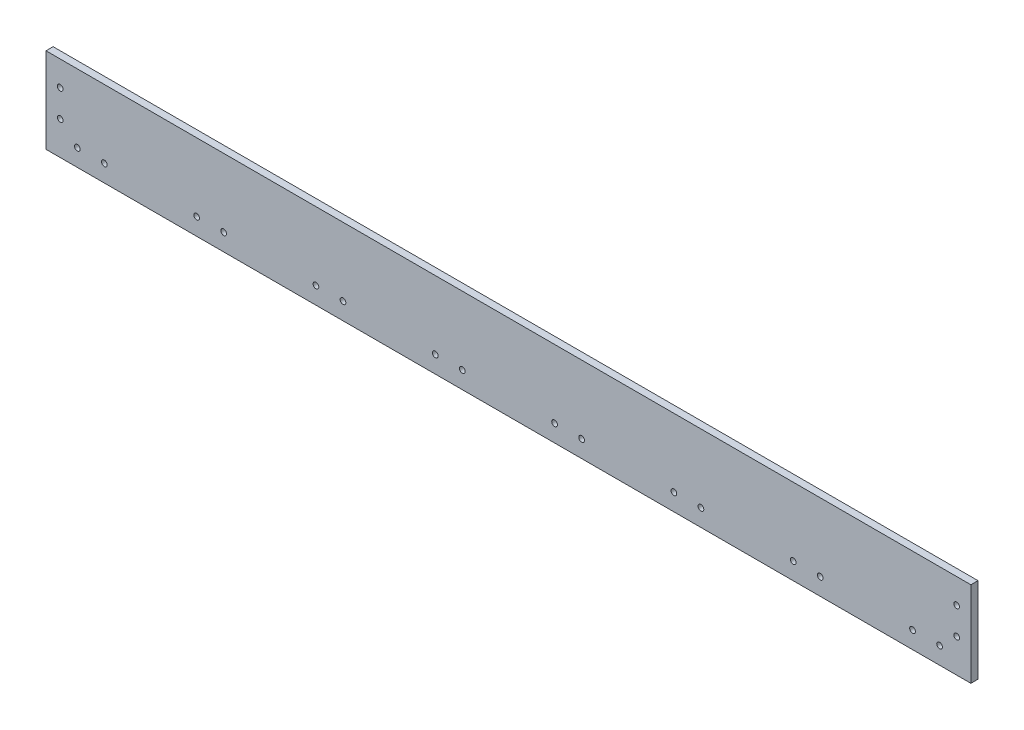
from build123d import *

# Parameters (mm, degrees)
SKETCH1_W           = 825.5
SKETCH1_H           = 76.2
BOSS_EXTRUDE1_DEPTH = 6.35
SKETCH2_R           = 2.54
CUT_EXTRUDE1_DEPTH  = 6.35
SKETCH3_R           = 2.54
CUT_EXTRUDE2_DEPTH  = 6.35
LPATTERN2_COUNT     = 8
LPATTERN2_PITCH     = 106.498571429


with BuildPart() as part:
    # Sketch1 → Boss-Extrude1 (new body)
    with BuildSketch(Plane.XY):
        with Locations((412.75, 38.1)):
            Rectangle(SKETCH1_W, SKETCH1_H)
    extrude(amount=BOSS_EXTRUDE1_DEPTH)

    # Sketch2 → Cut-Extrude1 (cut)
    with BuildSketch(Plane.XY.offset(6.35)):
        with Locations((27.94, 15.24)):
            Circle(SKETCH2_R)
        with Locations((52.07, 15.24)):
            Circle(SKETCH2_R)
    cut_extrude1 = extrude(amount=-CUT_EXTRUDE1_DEPTH, mode=Mode.SUBTRACT)

    # Sketch3 → Cut-Extrude2 (cut)
    with BuildSketch(Plane.XY.offset(6.35)):
        with Locations((12.7, 29.845)):
            Circle(SKETCH3_R)
        with Locations((12.7, 53.975)):
            Circle(SKETCH3_R)
        with Locations(Location((812.8, 29.845, 0), (0, 0, 180))):
            Circle(SKETCH3_R)
        with Locations(Location((812.8, 53.975, 0), (0, 0, 180))):
            Circle(SKETCH3_R)
    extrude(amount=-CUT_EXTRUDE2_DEPTH, mode=Mode.SUBTRACT)

    # LPattern2: Cut-Extrude1 ×8
    with Locations(*[(i * LPATTERN2_PITCH, 0, 0) for i in range(1, LPATTERN2_COUNT)]):
        add(cut_extrude1, mode=Mode.SUBTRACT)


solid = part.part
